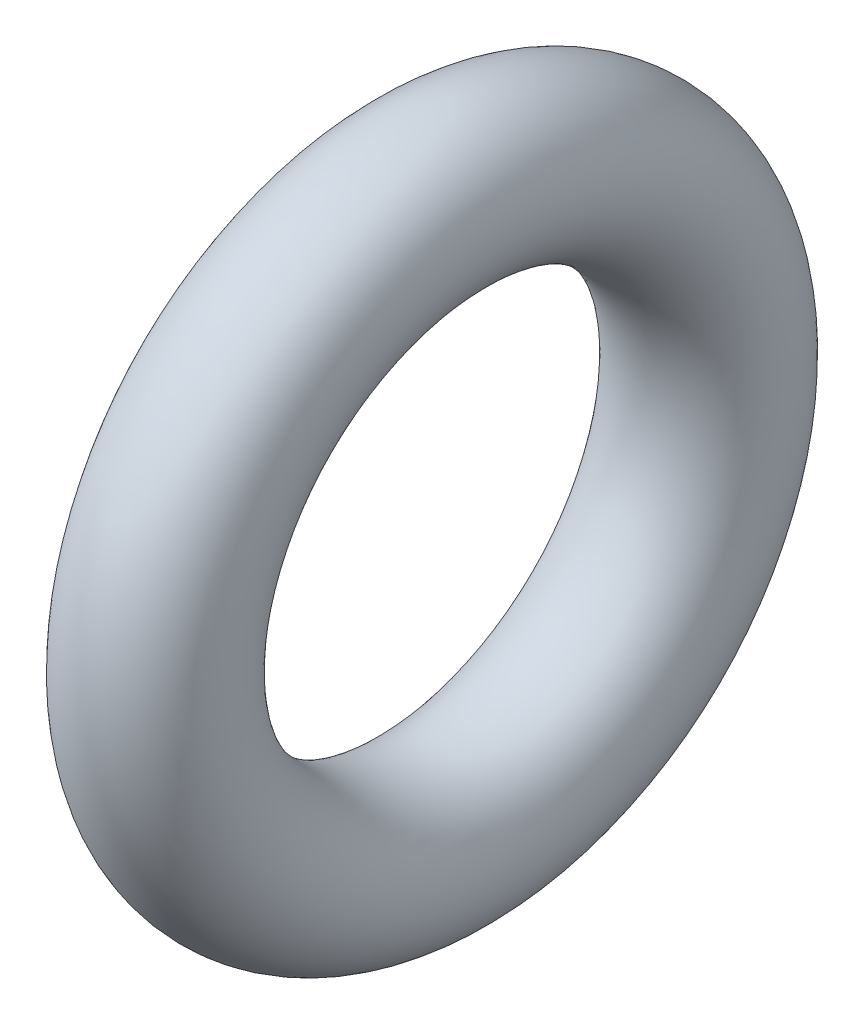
ISO-10303-21;
HEADER;
FILE_DESCRIPTION(('STEP AP214'),'2;1');
FILE_NAME('part.step','',(''),(''),'','','');
FILE_SCHEMA(('AUTOMOTIVE_DESIGN { 1 0 10303 214 1 1 1 1 }'));
ENDSEC;
DATA;
#1=APPLICATION_CONTEXT('core data for automotive mechanical design processes');
#2=APPLICATION_PROTOCOL_DEFINITION('international standard','automotive_design',2000,#1);
#3=PRODUCT_CONTEXT('',#1,'mechanical');
#4=PRODUCT('Part','Part','',(#3));
#5=PRODUCT_RELATED_PRODUCT_CATEGORY('part','',(#4));
#6=PRODUCT_DEFINITION_FORMATION('','',#4);
#7=PRODUCT_DEFINITION_CONTEXT('part definition',#1,'design');
#8=PRODUCT_DEFINITION('design','',#6,#7);
#9=PRODUCT_DEFINITION_SHAPE('','',#8);
#10=(LENGTH_UNIT() NAMED_UNIT(*) SI_UNIT(.MILLI.,.METRE.));
#11=(NAMED_UNIT(*) PLANE_ANGLE_UNIT() SI_UNIT($,.RADIAN.));
#12=(NAMED_UNIT(*) SI_UNIT($,.STERADIAN.) SOLID_ANGLE_UNIT());
#13=UNCERTAINTY_MEASURE_WITH_UNIT(LENGTH_MEASURE(1.E-05),#10,'distance_accuracy_value','');
#14=(GEOMETRIC_REPRESENTATION_CONTEXT(3) GLOBAL_UNCERTAINTY_ASSIGNED_CONTEXT((#13)) GLOBAL_UNIT_ASSIGNED_CONTEXT((#10,
#11,#12)) REPRESENTATION_CONTEXT('',''));
#15=CARTESIAN_POINT('',(0.,0.,0.));
#16=DIRECTION('',(0.,0.,1.));
#17=DIRECTION('',(1.,0.,0.));
#18=AXIS2_PLACEMENT_3D('',#15,#16,#17);
#19=CARTESIAN_POINT('',(7.,0.,0.));
#20=DIRECTION('',(1.,0.,0.));
#21=DIRECTION('',(0.,0.877582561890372,0.479425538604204));
#22=AXIS2_PLACEMENT_3D('',#19,#20,#21);
#23=TOROIDAL_SURFACE('',#22,16.75,4.66666666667);
#24=ADVANCED_FACE('F14',(),#23,.T.);
#25=CLOSED_SHELL('',(#24));
#26=MANIFOLD_SOLID_BREP('B1',#25);
#27=ADVANCED_BREP_SHAPE_REPRESENTATION('',(#18,#26),#14);
#28=SHAPE_DEFINITION_REPRESENTATION(#9,#27);
ENDSEC;
END-ISO-10303-21;
